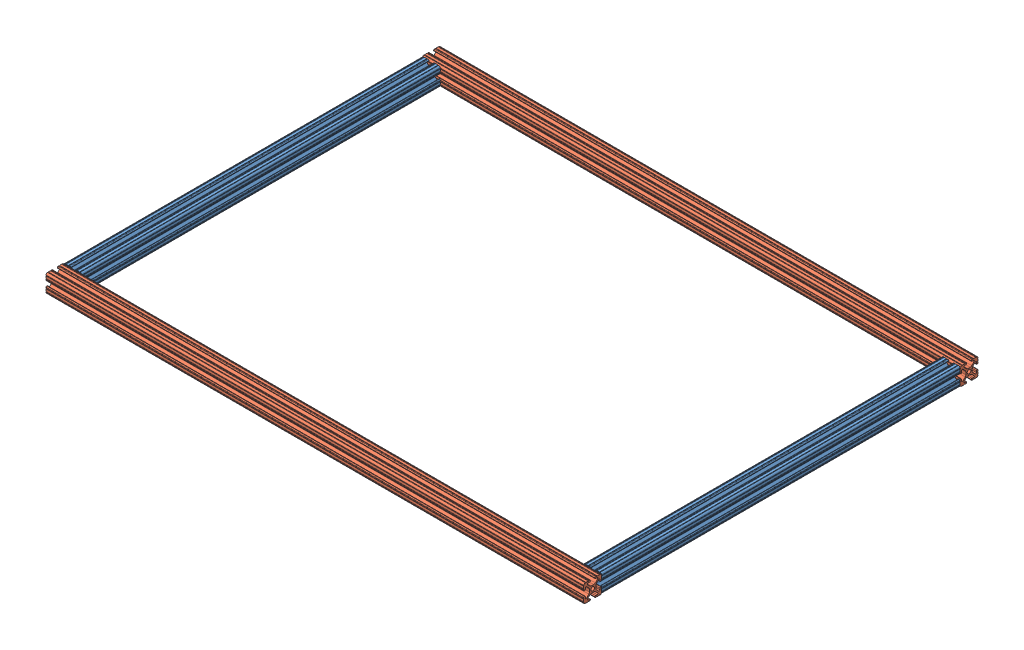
SolidWorks assembly Assem1.sldasm, configuration Default (file format 9000). Lengths in mm.
Overall size (762 25.4 558.8).
4 component instances, 2 part files, 9 mates.
Components (placement in the parent):
- 1010 20in-1: 1010 20in.SLDPRT [Default] at (-280.6759 639.2381 176.9952) size (25.4 25.4 508)
- 1010 30in-1: 1010 30in.SLDPRT [Default] at (-1029.9759 639.2381 189.6952) x (0 0 1) z (-1 0 0) size (25.4 25.4 762)
- 1010 30in-2: 1010 30in.SLDPRT [Default] at (-267.9759 639.2381 -343.7048) x (0 -1 0) z (1 0 0) size (25.4 25.4 762)
- 1010 20in-2: 1010 20in.SLDPRT [Default] at (-1017.2759 639.2381 176.9952) size (25.4 25.4 508)
Mates (geometry in assembly coordinates):
- Coincident4: coincident anti-aligned: plane of 1010 20in-1 through (-282.3852 631.5673 176.9952) normal (0 0 1); plane of 1010 30in-1 through (-267.9759 645.5712 176.9952) normal (0 0 -1)
- Coincident5: coincident aligned: plane of 1010 20in-1 through (-267.9759 645.5712 -331.0048) normal (1 0 0); plane of 1010 30in-1 through (-267.9759 631.5673 187.986) normal (1 0 0)
- Coincident6: coincident aligned: plane of 1010 20in-1 through (-274.3428 626.5381 -331.0048) normal (0 -1 0); plane of 1010 30in-1 through (-267.9759 626.5381 183.3621) normal (0 -1 0)
- Coincident10: coincident: plane of 1010 20in-1 through (-282.3852 631.5673 -331.0048) normal (0 0 -1); plane of 1010 30in-2 through (-1029.9759 645.5712 -331.0048) normal (0 0 1)
- Coincident11: coincident: plane of 1010 20in-1 through (-267.9759 645.5712 -331.0048) normal (1 0 0); plane of 1010 30in-2 through (-267.9759 640.9473 -336.034) normal (1 0 0)
- Coincident12: coincident aligned: plane of 1010 20in-1 through (-271.1255 651.9381 -331.0048) normal (0 1 0); plane of 1010 30in-2 through (-1029.9759 651.9381 -334.1544) normal (0 1 0)
- Coincident13: coincident: plane of 1010 30in-1 through (-267.9759 645.5712 176.9952) normal (0 0 -1); plane of 1010 20in-2 through (-1018.9852 631.5673 176.9952) normal (0 0 1)
- Tangent1: tangent: plane of 1010 30in-1 through (-267.9759 626.5381 183.3621) normal (0 -1 0); cylinder of 1010 20in-2 through (-1027.8677 628.6463 -331.0048) axis (0 0 1) radius 2.1082
- Coincident14: coincident aligned: plane of 1010 30in-1 through (-1029.9759 631.5673 187.986) normal (-1 0 0); plane of 1010 20in-2 through (-1029.9759 645.5712 -331.0048) normal (-1 0 0)
